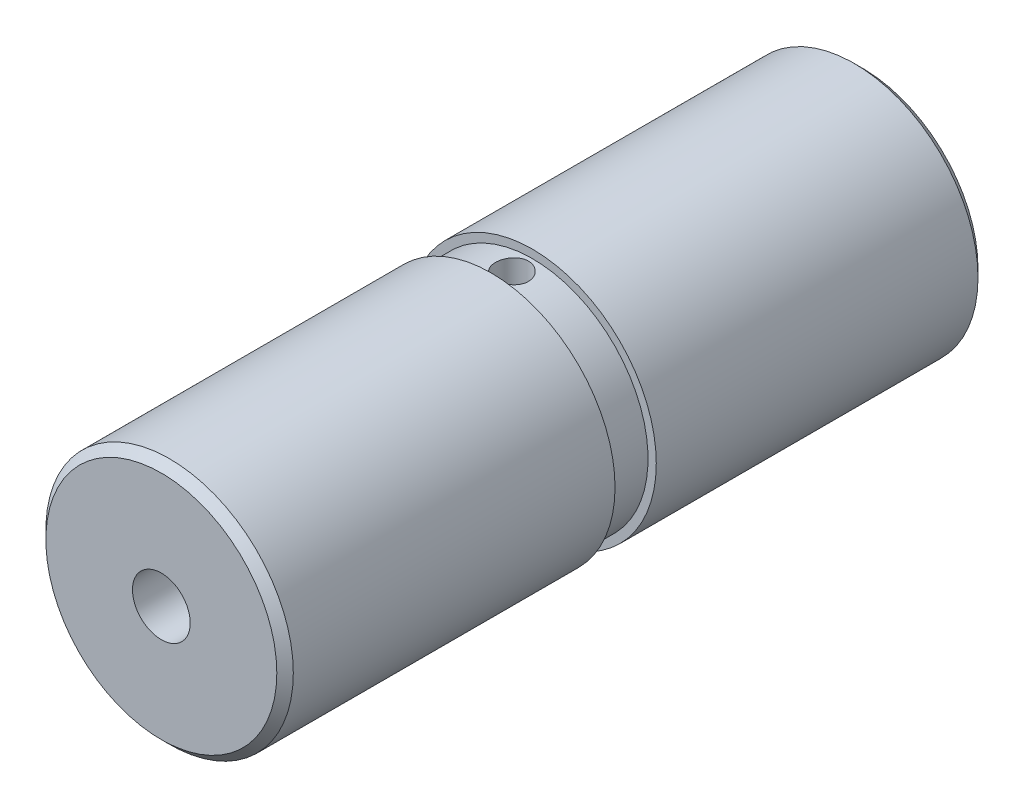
ISO-10303-21;
HEADER;
FILE_DESCRIPTION(('STEP AP214'),'2;1');
FILE_NAME('part.step','',(''),(''),'','','');
FILE_SCHEMA(('AUTOMOTIVE_DESIGN { 1 0 10303 214 1 1 1 1 }'));
ENDSEC;
DATA;
#1=APPLICATION_CONTEXT('core data for automotive mechanical design processes');
#2=APPLICATION_PROTOCOL_DEFINITION('international standard','automotive_design',2000,#1);
#3=PRODUCT_CONTEXT('',#1,'mechanical');
#4=PRODUCT('Part','Part','',(#3));
#5=PRODUCT_RELATED_PRODUCT_CATEGORY('part','',(#4));
#6=PRODUCT_DEFINITION_FORMATION('','',#4);
#7=PRODUCT_DEFINITION_CONTEXT('part definition',#1,'design');
#8=PRODUCT_DEFINITION('design','',#6,#7);
#9=PRODUCT_DEFINITION_SHAPE('','',#8);
#10=(LENGTH_UNIT() NAMED_UNIT(*) SI_UNIT(.MILLI.,.METRE.));
#11=(NAMED_UNIT(*) PLANE_ANGLE_UNIT() SI_UNIT($,.RADIAN.));
#12=(NAMED_UNIT(*) SI_UNIT($,.STERADIAN.) SOLID_ANGLE_UNIT());
#13=UNCERTAINTY_MEASURE_WITH_UNIT(LENGTH_MEASURE(1.E-05),#10,'distance_accuracy_value','');
#14=(GEOMETRIC_REPRESENTATION_CONTEXT(3) GLOBAL_UNCERTAINTY_ASSIGNED_CONTEXT((#13)) GLOBAL_UNIT_ASSIGNED_CONTEXT((#10,
#11,#12)) REPRESENTATION_CONTEXT('',''));
#15=CARTESIAN_POINT('',(0.,0.,0.));
#16=DIRECTION('',(0.,0.,1.));
#17=DIRECTION('',(1.,0.,0.));
#18=AXIS2_PLACEMENT_3D('',#15,#16,#17);
#19=CARTESIAN_POINT('',(0.,0.,-85.));
#20=DIRECTION('',(0.,0.,1.));
#21=DIRECTION('',(1.,0.,0.));
#22=AXIS2_PLACEMENT_3D('',#19,#20,#21);
#23=CYLINDRICAL_SURFACE('',#22,15.);
#24=CARTESIAN_POINT('',(0.,0.,-1.00000000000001));
#25=DIRECTION('',(0.,0.,1.));
#26=DIRECTION('',(1.,0.,0.));
#27=AXIS2_PLACEMENT_3D('',#24,#25,#26);
#28=CIRCLE('',#27,15.);
#29=CARTESIAN_POINT('',(15.,0.,-1.00000000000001));
#30=VERTEX_POINT('',#29);
#31=EDGE_CURVE('E85',#30,#30,#28,.F.);
#32=ORIENTED_EDGE('',*,*,#31,.T.);
#33=EDGE_LOOP('',(#32));
#34=FACE_BOUND('',#33,.T.);
#35=CARTESIAN_POINT('',(0.,0.,-40.));
#36=DIRECTION('',(0.,0.,-1.));
#37=DIRECTION('',(-1.,0.,0.));
#38=AXIS2_PLACEMENT_3D('',#35,#36,#37);
#39=CIRCLE('',#38,15.);
#40=CARTESIAN_POINT('',(-15.,0.,-40.));
#41=VERTEX_POINT('',#40);
#42=EDGE_CURVE('E151',#41,#41,#39,.T.);
#43=ORIENTED_EDGE('',*,*,#42,.F.);
#44=EDGE_LOOP('',(#43));
#45=FACE_BOUND('',#44,.T.);
#46=ADVANCED_FACE('F38',(#34,#45),#23,.T.);
#47=CARTESIAN_POINT('',(0.,0.,-84.));
#48=DIRECTION('',(0.,0.,1.));
#49=DIRECTION('',(1.,0.,0.));
#50=AXIS2_PLACEMENT_3D('',#47,#48,#49);
#51=CIRCLE('',#50,15.);
#52=CARTESIAN_POINT('',(15.,0.,-84.));
#53=VERTEX_POINT('',#52);
#54=EDGE_CURVE('E88',#53,#53,#51,.T.);
#55=ORIENTED_EDGE('',*,*,#54,.T.);
#56=EDGE_LOOP('',(#55));
#57=FACE_BOUND('',#56,.T.);
#58=CARTESIAN_POINT('',(0.,0.,-45.));
#59=DIRECTION('',(0.,0.,-1.));
#60=DIRECTION('',(-1.,0.,0.));
#61=AXIS2_PLACEMENT_3D('',#58,#59,#60);
#62=CIRCLE('',#61,15.);
#63=CARTESIAN_POINT('',(-15.,0.,-45.));
#64=VERTEX_POINT('',#63);
#65=EDGE_CURVE('E142',#64,#64,#62,.T.);
#66=ORIENTED_EDGE('',*,*,#65,.T.);
#67=EDGE_LOOP('',(#66));
#68=FACE_BOUND('',#67,.T.);
#69=ADVANCED_FACE('F115',(#57,#68),#23,.T.);
#70=CARTESIAN_POINT('',(0.,0.,-42.5));
#71=DIRECTION('',(0.,-1.,0.));
#72=DIRECTION('',(0.,0.,-1.));
#73=AXIS2_PLACEMENT_3D('',#70,#71,#72);
#74=CYLINDRICAL_SURFACE('',#73,1.99999999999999);
#75=CARTESIAN_POINT('',(0.,0.,-42.5));
#76=DIRECTION('',(0.,0.707106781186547,0.707106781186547));
#77=DIRECTION('',(0.,-0.707106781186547,0.707106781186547));
#78=AXIS2_PLACEMENT_3D('',#75,#76,#77);
#79=ELLIPSE('',#78,2.82842712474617,1.99999999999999);
#80=CARTESIAN_POINT('',(1.99999999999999,0.,-42.5));
#81=VERTEX_POINT('',#80);
#82=CARTESIAN_POINT('',(-1.99999999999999,0.,-42.5));
#83=VERTEX_POINT('',#82);
#84=EDGE_CURVE('E61',#81,#83,#79,.T.);
#85=ORIENTED_EDGE('',*,*,#84,.F.);
#86=CARTESIAN_POINT('',(0.,0.,-42.5));
#87=DIRECTION('',(0.,-0.707106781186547,0.707106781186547));
#88=DIRECTION('',(0.,0.707106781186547,0.707106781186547));
#89=AXIS2_PLACEMENT_3D('',#86,#87,#88);
#90=ELLIPSE('',#89,2.82842712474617,1.99999999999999);
#91=EDGE_CURVE('E59',#83,#81,#90,.F.);
#92=ORIENTED_EDGE('',*,*,#91,.F.);
#93=EDGE_LOOP('',(#85,#92));
#94=FACE_BOUND('',#93,.T.);
#95=CARTESIAN_POINT('',(0.,14.,-44.5));
#96=CARTESIAN_POINT('',(0.111730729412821,13.9999982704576,-44.4999953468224));
#97=CARTESIAN_POINT('',(0.223527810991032,13.9986484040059,-44.4906055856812));
#98=CARTESIAN_POINT('',(0.44400132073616,13.9933934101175,-44.453301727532));
#99=CARTESIAN_POINT('',(0.552674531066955,13.9894857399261,-44.4253691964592));
#100=CARTESIAN_POINT('',(0.763677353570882,13.9795546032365,-44.3518278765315));
#101=CARTESIAN_POINT('',(0.866011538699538,13.9735326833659,-44.306232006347));
#102=CARTESIAN_POINT('',(1.06155930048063,13.9600397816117,-44.1986889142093));
#103=CARTESIAN_POINT('',(1.15477423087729,13.9525690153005,-44.1367441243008));
#104=CARTESIAN_POINT('',(1.33011730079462,13.9369507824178,-43.9977916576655));
#105=CARTESIAN_POINT('',(1.4121711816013,13.9287993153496,-43.9206907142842));
#106=CARTESIAN_POINT('',(1.56222258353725,13.9127699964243,-43.7538151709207));
#107=CARTESIAN_POINT('',(1.63021932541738,13.9048921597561,-43.664039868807));
#108=CARTESIAN_POINT('',(1.75051175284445,13.8902631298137,-43.4738697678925));
#109=CARTESIAN_POINT('',(1.80273625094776,13.8835171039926,-43.3734295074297));
#110=CARTESIAN_POINT('',(1.88954690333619,13.8719696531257,-43.1650909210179));
#111=CARTESIAN_POINT('',(1.92413392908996,13.8671681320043,-43.0571929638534));
#112=CARTESIAN_POINT('',(1.97445864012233,13.8600923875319,-42.837779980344));
#113=CARTESIAN_POINT('',(1.9903229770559,13.8578011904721,-42.7262945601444));
#114=CARTESIAN_POINT('',(2.00314420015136,13.8559538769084,-42.5022221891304));
#115=CARTESIAN_POINT('',(2.00010207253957,13.8563976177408,-42.3896352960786));
#116=CARTESIAN_POINT('',(1.97530036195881,13.8599545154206,-42.1674469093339));
#117=CARTESIAN_POINT('',(1.95368136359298,13.8630476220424,-42.0578293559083));
#118=CARTESIAN_POINT('',(1.89255944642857,13.8715234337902,-41.8437938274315));
#119=CARTESIAN_POINT('',(1.85305606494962,13.8769061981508,-41.7393759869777));
#120=CARTESIAN_POINT('',(1.75713904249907,13.8893771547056,-41.5382734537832));
#121=CARTESIAN_POINT('',(1.70066538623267,13.8964713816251,-41.4416177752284));
#122=CARTESIAN_POINT('',(1.57245369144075,13.9115614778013,-41.2591015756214));
#123=CARTESIAN_POINT('',(1.5007147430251,13.9195574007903,-41.1732416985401));
#124=CARTESIAN_POINT('',(1.34323491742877,13.935638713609,-41.0139391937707));
#125=CARTESIAN_POINT('',(1.25737307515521,13.9437242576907,-40.9406161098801));
#126=CARTESIAN_POINT('',(1.07449831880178,13.9590063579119,-40.8094029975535));
#127=CARTESIAN_POINT('',(0.977485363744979,13.9662029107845,-40.7515130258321));
#128=CARTESIAN_POINT('',(0.774962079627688,13.9789027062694,-40.6528051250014));
#129=CARTESIAN_POINT('',(0.66944745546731,13.9844050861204,-40.6119958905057));
#130=CARTESIAN_POINT('',(0.452966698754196,13.9930891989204,-40.5487090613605));
#131=CARTESIAN_POINT('',(0.342000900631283,13.9962710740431,-40.5262303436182));
#132=CARTESIAN_POINT('',(0.118800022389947,13.9999369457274,-40.5004003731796));
#133=CARTESIAN_POINT('',(0.0065843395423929,14.0004441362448,-40.4968846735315));
#134=CARTESIAN_POINT('',(-0.216834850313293,13.998766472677,-40.5086448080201));
#135=CARTESIAN_POINT('',(-0.328038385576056,13.9965816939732,-40.5239201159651));
#136=CARTESIAN_POINT('',(-0.545782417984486,13.989779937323,-40.5726919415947));
#137=CARTESIAN_POINT('',(-0.652341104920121,13.9851735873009,-40.6061088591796));
#138=CARTESIAN_POINT('',(-0.858342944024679,13.9740437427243,-40.6901317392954));
#139=CARTESIAN_POINT('',(-0.957785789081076,13.9675201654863,-40.7407384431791));
#140=CARTESIAN_POINT('',(-1.14745969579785,13.9532237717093,-40.8580938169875));
#141=CARTESIAN_POINT('',(-1.23762521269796,13.9454429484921,-40.9249474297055));
#142=CARTESIAN_POINT('',(-1.40551529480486,13.9295244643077,-41.0727520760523));
#143=CARTESIAN_POINT('',(-1.48323920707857,13.9213867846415,-41.1537038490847));
#144=CARTESIAN_POINT('',(-1.62463364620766,13.905598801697,-41.3281367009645));
#145=CARTESIAN_POINT('',(-1.68819430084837,13.8979526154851,-41.4217072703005));
#146=CARTESIAN_POINT('',(-1.79869568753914,13.8840847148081,-41.618293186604));
#147=CARTESIAN_POINT('',(-1.84563683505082,13.8778629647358,-41.7213082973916));
#148=CARTESIAN_POINT('',(-1.92139410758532,13.8675777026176,-41.9335233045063));
#149=CARTESIAN_POINT('',(-1.9502693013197,13.8635071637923,-42.0427017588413));
#150=CARTESIAN_POINT('',(-1.98926373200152,13.8579660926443,-42.2644205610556));
#151=CARTESIAN_POINT('',(-1.99938413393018,13.8564953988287,-42.3769606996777));
#152=CARTESIAN_POINT('',(-2.0005559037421,13.8563261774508,-42.6011138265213));
#153=CARTESIAN_POINT('',(-1.99177997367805,13.8576025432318,-42.7127259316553));
#154=CARTESIAN_POINT('',(-1.95577695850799,13.8627292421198,-42.9328701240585));
#155=CARTESIAN_POINT('',(-1.9285498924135,13.8665795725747,-43.041402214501));
#156=CARTESIAN_POINT('',(-1.85647645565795,13.8764118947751,-43.2522652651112));
#157=CARTESIAN_POINT('',(-1.811641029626,13.8823925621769,-43.354600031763));
#158=CARTESIAN_POINT('',(-1.70564064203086,13.8958134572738,-43.5503224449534));
#159=CARTESIAN_POINT('',(-1.64447523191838,13.9032537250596,-43.6437098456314));
#160=CARTESIAN_POINT('',(-1.50691947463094,13.9188366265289,-43.8197658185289));
#161=CARTESIAN_POINT('',(-1.43040092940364,13.9269848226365,-43.9023337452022));
#162=CARTESIAN_POINT('',(-1.26458151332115,13.9430182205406,-44.0535197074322));
#163=CARTESIAN_POINT('',(-1.17527766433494,13.9509033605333,-44.1221344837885));
#164=CARTESIAN_POINT('',(-0.985903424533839,13.9655666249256,-44.2437675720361));
#165=CARTESIAN_POINT('',(-0.885781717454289,13.9723390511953,-44.2967066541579));
#166=CARTESIAN_POINT('',(-0.678021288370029,13.9839575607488,-44.3849397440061));
#167=CARTESIAN_POINT('',(-0.570390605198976,13.9888056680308,-44.4202523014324));
#168=CARTESIAN_POINT('',(-0.385211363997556,13.9949036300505,-44.4640835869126));
#169=CARTESIAN_POINT('',(-0.308813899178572,13.9968051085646,-44.4775320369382));
#170=CARTESIAN_POINT('',(-0.154954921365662,13.9993538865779,-44.4954918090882));
#171=CARTESIAN_POINT('',(-0.0774934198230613,14.0000011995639,-44.5000032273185));
#172=CARTESIAN_POINT('',(0.,14.,-44.5));
#173=B_SPLINE_CURVE_WITH_KNOTS('',3,(#95,#96,#97,#98,#99,#100,#101,#102,#103,#104,#105,#106,
#107,#108,#109,#110,#111,#112,#113,#114,#115,#116,#117,#118,#119,#120,#121,#122,#123,#124,#125,
#126,#127,#128,#129,#130,#131,#132,#133,#134,#135,#136,#137,#138,#139,#140,#141,#142,#143,#144,
#145,#146,#147,#148,#149,#150,#151,#152,#153,#154,#155,#156,#157,#158,#159,#160,#161,#162,#163,
#164,#165,#166,#167,#168,#169,#170,#171,#172),.UNSPECIFIED.,.T.,.F.,(4,2,2,2,2,2,2,2,2,2,2,2,2,
2,2,2,2,2,2,2,2,2,2,2,2,2,2,2,2,2,2,2,2,2,2,2,2,2,4),(0.,0.334909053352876,0.670151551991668,
1.0051493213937,1.34009728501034,1.67717486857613,2.01427113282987,2.35286688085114,
2.69144589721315,3.02772118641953,3.36397893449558,3.69771416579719,4.03145803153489,
4.36639635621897,4.70135465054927,5.03934756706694,5.37734172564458,5.71550772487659,
6.05365300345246,6.38886112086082,6.72405985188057,7.05779957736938,7.39155369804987,
7.72752375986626,8.06351144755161,8.40202124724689,8.74052258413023,9.07791128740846,
9.41527903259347,9.74957651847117,10.0838736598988,10.4179633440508,10.752062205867,
11.0890764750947,11.4261693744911,11.7649380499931,12.1033494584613,12.3356358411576,
12.5679197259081),.UNSPECIFIED.);
#174=CARTESIAN_POINT('',(0.,14.,-44.5));
#175=VERTEX_POINT('',#174);
#176=EDGE_CURVE('E42',#175,#175,#173,.T.);
#177=ORIENTED_EDGE('',*,*,#176,.F.);
#178=EDGE_LOOP('',(#177));
#179=FACE_BOUND('',#178,.T.);
#180=ADVANCED_FACE('F62',(#94,#179),#74,.F.);
#181=CARTESIAN_POINT('',(0.,0.,-85.));
#182=DIRECTION('',(0.,0.,1.));
#183=DIRECTION('',(1.,0.,0.));
#184=AXIS2_PLACEMENT_3D('',#181,#182,#183);
#185=PLANE('',#184);
#186=CARTESIAN_POINT('',(0.,0.,-85.));
#187=DIRECTION('',(0.,0.,-1.));
#188=DIRECTION('',(-1.,0.,0.));
#189=AXIS2_PLACEMENT_3D('',#186,#187,#188);
#190=CIRCLE('',#189,3.49999999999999);
#191=CARTESIAN_POINT('',(-3.49999999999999,0.,-85.));
#192=VERTEX_POINT('',#191);
#193=EDGE_CURVE('E71',#192,#192,#190,.T.);
#194=ORIENTED_EDGE('',*,*,#193,.F.);
#195=EDGE_LOOP('',(#194));
#196=FACE_BOUND('',#195,.T.);
#197=CARTESIAN_POINT('',(0.,0.,-85.));
#198=DIRECTION('',(0.,0.,1.));
#199=DIRECTION('',(1.,0.,0.));
#200=AXIS2_PLACEMENT_3D('',#197,#198,#199);
#201=CIRCLE('',#200,14.);
#202=CARTESIAN_POINT('',(14.,0.,-85.));
#203=VERTEX_POINT('',#202);
#204=EDGE_CURVE('E52',#203,#203,#201,.F.);
#205=ORIENTED_EDGE('',*,*,#204,.T.);
#206=EDGE_LOOP('',(#205));
#207=FACE_BOUND('',#206,.T.);
#208=ADVANCED_FACE('F134',(#196,#207),#185,.F.);
#209=CARTESIAN_POINT('',(0.,0.,0.));
#210=DIRECTION('',(0.,0.,1.));
#211=DIRECTION('',(1.,0.,0.));
#212=AXIS2_PLACEMENT_3D('',#209,#210,#211);
#213=PLANE('',#212);
#214=CARTESIAN_POINT('',(0.,0.,0.));
#215=DIRECTION('',(0.,0.,1.));
#216=DIRECTION('',(1.,0.,0.));
#217=AXIS2_PLACEMENT_3D('',#214,#215,#216);
#218=CIRCLE('',#217,3.5);
#219=CARTESIAN_POINT('',(3.5,0.,0.));
#220=VERTEX_POINT('',#219);
#221=EDGE_CURVE('E81',#220,#220,#218,.T.);
#222=ORIENTED_EDGE('',*,*,#221,.F.);
#223=EDGE_LOOP('',(#222));
#224=FACE_BOUND('',#223,.T.);
#225=CARTESIAN_POINT('',(0.,0.,0.));
#226=DIRECTION('',(0.,0.,1.));
#227=DIRECTION('',(1.,0.,0.));
#228=AXIS2_PLACEMENT_3D('',#225,#226,#227);
#229=CIRCLE('',#228,14.);
#230=CARTESIAN_POINT('',(14.,0.,0.));
#231=VERTEX_POINT('',#230);
#232=EDGE_CURVE('E11',#231,#231,#229,.T.);
#233=ORIENTED_EDGE('',*,*,#232,.T.);
#234=EDGE_LOOP('',(#233));
#235=FACE_BOUND('',#234,.T.);
#236=ADVANCED_FACE('F124',(#224,#235),#213,.T.);
#237=CARTESIAN_POINT('',(0.,0.,-84.));
#238=DIRECTION('',(0.,0.,1.));
#239=DIRECTION('',(1.,0.,0.));
#240=AXIS2_PLACEMENT_3D('',#237,#238,#239);
#241=CONICAL_SURFACE('',#240,15.,0.785398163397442);
#242=ORIENTED_EDGE('',*,*,#204,.F.);
#243=EDGE_LOOP('',(#242));
#244=FACE_BOUND('',#243,.T.);
#245=ORIENTED_EDGE('',*,*,#54,.F.);
#246=EDGE_LOOP('',(#245));
#247=FACE_BOUND('',#246,.T.);
#248=ADVANCED_FACE('F126',(#244,#247),#241,.T.);
#249=CARTESIAN_POINT('',(0.,0.,0.));
#250=DIRECTION('',(0.,0.,-1.));
#251=DIRECTION('',(-1.,0.,0.));
#252=AXIS2_PLACEMENT_3D('',#249,#250,#251);
#253=CONICAL_SURFACE('',#252,14.,0.785398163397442);
#254=ORIENTED_EDGE('',*,*,#31,.F.);
#255=EDGE_LOOP('',(#254));
#256=FACE_BOUND('',#255,.T.);
#257=ORIENTED_EDGE('',*,*,#232,.F.);
#258=EDGE_LOOP('',(#257));
#259=FACE_BOUND('',#258,.T.);
#260=ADVANCED_FACE('F40',(#256,#259),#253,.T.);
#261=CARTESIAN_POINT('',(0.,0.,0.));
#262=DIRECTION('',(0.,0.,1.));
#263=DIRECTION('',(1.,0.,0.));
#264=AXIS2_PLACEMENT_3D('',#261,#262,#263);
#265=CYLINDRICAL_SURFACE('',#264,1.99999999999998);
#266=ORIENTED_EDGE('',*,*,#84,.T.);
#267=ORIENTED_EDGE('',*,*,#91,.T.);
#268=EDGE_LOOP('',(#266,#267));
#269=FACE_BOUND('',#268,.T.);
#270=CARTESIAN_POINT('',(0.,0.,-63.0987090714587));
#271=DIRECTION('',(0.,0.,-1.));
#272=DIRECTION('',(-1.,0.,0.));
#273=AXIS2_PLACEMENT_3D('',#270,#271,#272);
#274=CIRCLE('',#273,1.99999999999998);
#275=CARTESIAN_POINT('',(-1.99999999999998,0.,-63.0987090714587));
#276=VERTEX_POINT('',#275);
#277=EDGE_CURVE('E77',#276,#276,#274,.T.);
#278=ORIENTED_EDGE('',*,*,#277,.T.);
#279=EDGE_LOOP('',(#278));
#280=FACE_BOUND('',#279,.T.);
#281=CARTESIAN_POINT('',(0.,0.,-21.9012909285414));
#282=DIRECTION('',(0.,0.,1.));
#283=DIRECTION('',(1.,0.,0.));
#284=AXIS2_PLACEMENT_3D('',#281,#282,#283);
#285=CIRCLE('',#284,1.99999999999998);
#286=CARTESIAN_POINT('',(1.99999999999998,0.,-21.9012909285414));
#287=VERTEX_POINT('',#286);
#288=EDGE_CURVE('E84',#287,#287,#285,.T.);
#289=ORIENTED_EDGE('',*,*,#288,.T.);
#290=EDGE_LOOP('',(#289));
#291=FACE_BOUND('',#290,.T.);
#292=ADVANCED_FACE('F66',(#269,#280,#291),#265,.F.);
#293=CARTESIAN_POINT('',(0.,0.,-21.));
#294=DIRECTION('',(0.,0.,1.));
#295=DIRECTION('',(1.,0.,0.));
#296=AXIS2_PLACEMENT_3D('',#293,#294,#295);
#297=CONICAL_SURFACE('',#296,3.49999999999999,1.02974425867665);
#298=CARTESIAN_POINT('',(0.,0.,-21.));
#299=DIRECTION('',(0.,0.,1.));
#300=DIRECTION('',(1.,0.,0.));
#301=AXIS2_PLACEMENT_3D('',#298,#299,#300);
#302=CIRCLE('',#301,3.49999999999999);
#303=CARTESIAN_POINT('',(3.49999999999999,0.,-21.));
#304=VERTEX_POINT('',#303);
#305=EDGE_CURVE('E78',#304,#304,#302,.T.);
#306=ORIENTED_EDGE('',*,*,#305,.T.);
#307=EDGE_LOOP('',(#306));
#308=FACE_BOUND('',#307,.T.);
#309=ORIENTED_EDGE('',*,*,#288,.F.);
#310=EDGE_LOOP('',(#309));
#311=FACE_BOUND('',#310,.T.);
#312=ADVANCED_FACE('F111',(#308,#311),#297,.F.);
#313=CARTESIAN_POINT('',(0.,0.,0.));
#314=DIRECTION('',(0.,0.,1.));
#315=DIRECTION('',(1.,0.,0.));
#316=AXIS2_PLACEMENT_3D('',#313,#314,#315);
#317=CYLINDRICAL_SURFACE('',#316,3.5);
#318=ORIENTED_EDGE('',*,*,#305,.F.);
#319=EDGE_LOOP('',(#318));
#320=FACE_BOUND('',#319,.T.);
#321=ORIENTED_EDGE('',*,*,#221,.T.);
#322=EDGE_LOOP('',(#321));
#323=FACE_BOUND('',#322,.T.);
#324=ADVANCED_FACE('F101',(#320,#323),#317,.F.);
#325=CARTESIAN_POINT('',(0.,0.,-64.));
#326=DIRECTION('',(0.,0.,-1.));
#327=DIRECTION('',(-1.,0.,0.));
#328=AXIS2_PLACEMENT_3D('',#325,#326,#327);
#329=CONICAL_SURFACE('',#328,3.49999999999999,1.02974425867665);
#330=CARTESIAN_POINT('',(0.,0.,-64.));
#331=DIRECTION('',(0.,0.,-1.));
#332=DIRECTION('',(-1.,0.,0.));
#333=AXIS2_PLACEMENT_3D('',#330,#331,#332);
#334=CIRCLE('',#333,3.49999999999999);
#335=CARTESIAN_POINT('',(-3.49999999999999,0.,-64.));
#336=VERTEX_POINT('',#335);
#337=EDGE_CURVE('E68',#336,#336,#334,.T.);
#338=ORIENTED_EDGE('',*,*,#337,.T.);
#339=EDGE_LOOP('',(#338));
#340=FACE_BOUND('',#339,.T.);
#341=ORIENTED_EDGE('',*,*,#277,.F.);
#342=EDGE_LOOP('',(#341));
#343=FACE_BOUND('',#342,.T.);
#344=ADVANCED_FACE('F98',(#340,#343),#329,.F.);
#345=CARTESIAN_POINT('',(0.,0.,-85.));
#346=DIRECTION('',(0.,0.,-1.));
#347=DIRECTION('',(-1.,0.,0.));
#348=AXIS2_PLACEMENT_3D('',#345,#346,#347);
#349=CYLINDRICAL_SURFACE('',#348,3.49999999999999);
#350=ORIENTED_EDGE('',*,*,#337,.F.);
#351=EDGE_LOOP('',(#350));
#352=FACE_BOUND('',#351,.T.);
#353=ORIENTED_EDGE('',*,*,#193,.T.);
#354=EDGE_LOOP('',(#353));
#355=FACE_BOUND('',#354,.T.);
#356=ADVANCED_FACE('F100',(#352,#355),#349,.F.);
#357=CARTESIAN_POINT('',(0.,0.,-84.));
#358=DIRECTION('',(0.,0.,-1.));
#359=DIRECTION('',(-1.,0.,0.));
#360=AXIS2_PLACEMENT_3D('',#357,#358,#359);
#361=CYLINDRICAL_SURFACE('',#360,14.);
#362=CARTESIAN_POINT('',(0.,0.,-45.));
#363=DIRECTION('',(0.,0.,-1.));
#364=DIRECTION('',(-1.,0.,0.));
#365=AXIS2_PLACEMENT_3D('',#362,#363,#364);
#366=CIRCLE('',#365,14.);
#367=CARTESIAN_POINT('',(-14.,0.,-45.));
#368=VERTEX_POINT('',#367);
#369=EDGE_CURVE('E144',#368,#368,#366,.T.);
#370=ORIENTED_EDGE('',*,*,#369,.F.);
#371=EDGE_LOOP('',(#370));
#372=FACE_BOUND('',#371,.T.);
#373=CARTESIAN_POINT('',(0.,0.,-40.));
#374=DIRECTION('',(0.,0.,-1.));
#375=DIRECTION('',(-1.,0.,0.));
#376=AXIS2_PLACEMENT_3D('',#373,#374,#375);
#377=CIRCLE('',#376,14.);
#378=CARTESIAN_POINT('',(-14.,0.,-40.));
#379=VERTEX_POINT('',#378);
#380=EDGE_CURVE('E147',#379,#379,#377,.T.);
#381=ORIENTED_EDGE('',*,*,#380,.T.);
#382=EDGE_LOOP('',(#381));
#383=FACE_BOUND('',#382,.T.);
#384=ORIENTED_EDGE('',*,*,#176,.T.);
#385=EDGE_LOOP('',(#384));
#386=FACE_BOUND('',#385,.T.);
#387=ADVANCED_FACE('F108',(#372,#383,#386),#361,.T.);
#388=CARTESIAN_POINT('',(15.,0.,-40.));
#389=DIRECTION('',(0.,0.,-1.));
#390=DIRECTION('',(-1.,0.,0.));
#391=AXIS2_PLACEMENT_3D('',#388,#389,#390);
#392=PLANE('',#391);
#393=ORIENTED_EDGE('',*,*,#42,.T.);
#394=EDGE_LOOP('',(#393));
#395=FACE_BOUND('',#394,.T.);
#396=ORIENTED_EDGE('',*,*,#380,.F.);
#397=EDGE_LOOP('',(#396));
#398=FACE_BOUND('',#397,.T.);
#399=ADVANCED_FACE('F165',(#395,#398),#392,.T.);
#400=CARTESIAN_POINT('',(15.,0.,-45.));
#401=DIRECTION('',(0.,0.,1.));
#402=DIRECTION('',(1.,0.,0.));
#403=AXIS2_PLACEMENT_3D('',#400,#401,#402);
#404=PLANE('',#403);
#405=ORIENTED_EDGE('',*,*,#369,.T.);
#406=EDGE_LOOP('',(#405));
#407=FACE_BOUND('',#406,.T.);
#408=ORIENTED_EDGE('',*,*,#65,.F.);
#409=EDGE_LOOP('',(#408));
#410=FACE_BOUND('',#409,.T.);
#411=ADVANCED_FACE('F167',(#407,#410),#404,.T.);
#412=CLOSED_SHELL('',(#46,#69,#180,#208,#236,#248,#260,#292,#312,#324,#344,#356,#387,#399,#411));
#413=MANIFOLD_SOLID_BREP('B2',#412);
#414=ADVANCED_BREP_SHAPE_REPRESENTATION('',(#18,#413),#14);
#415=SHAPE_DEFINITION_REPRESENTATION(#9,#414);
ENDSEC;
END-ISO-10303-21;
